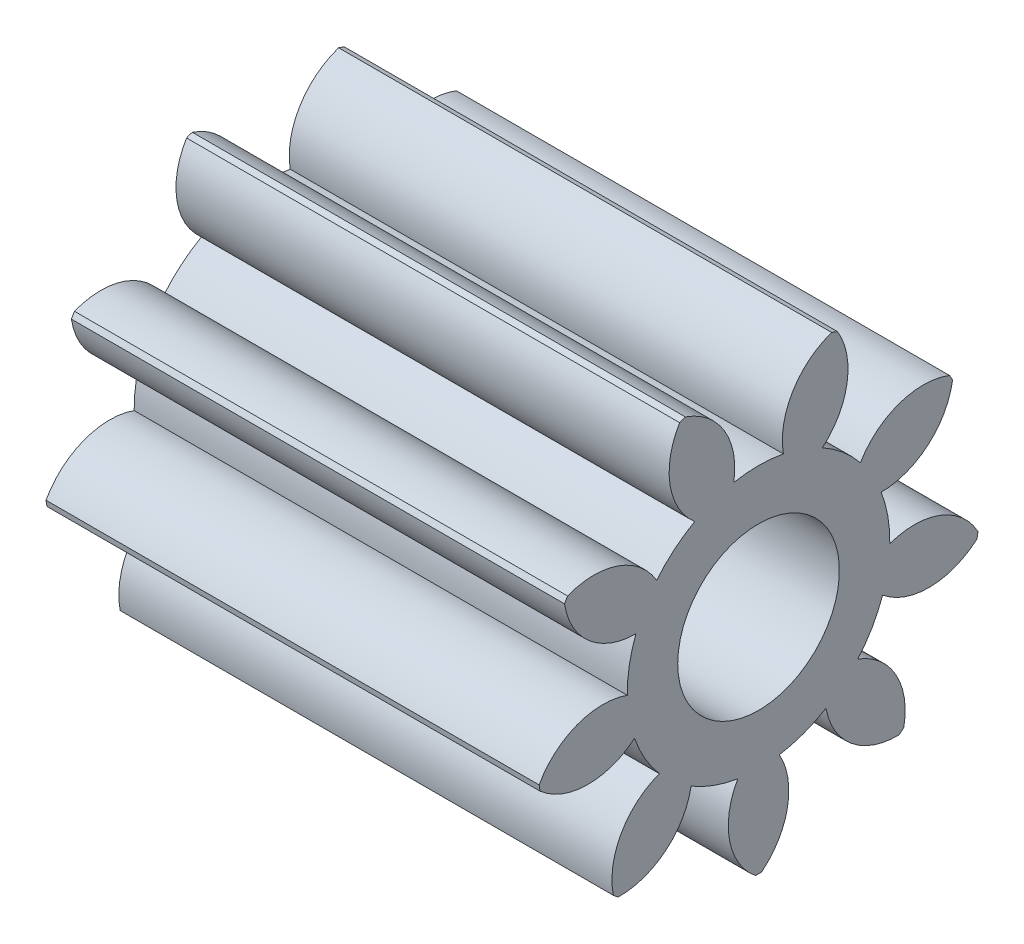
ISO-10303-21;
HEADER;
FILE_DESCRIPTION(('STEP AP214'),'2;1');
FILE_NAME('part.step','',(''),(''),'','','');
FILE_SCHEMA(('AUTOMOTIVE_DESIGN { 1 0 10303 214 1 1 1 1 }'));
ENDSEC;
DATA;
#1=APPLICATION_CONTEXT('core data for automotive mechanical design processes');
#2=APPLICATION_PROTOCOL_DEFINITION('international standard','automotive_design',2000,#1);
#3=PRODUCT_CONTEXT('',#1,'mechanical');
#4=PRODUCT('Part','Part','',(#3));
#5=PRODUCT_RELATED_PRODUCT_CATEGORY('part','',(#4));
#6=PRODUCT_DEFINITION_FORMATION('','',#4);
#7=PRODUCT_DEFINITION_CONTEXT('part definition',#1,'design');
#8=PRODUCT_DEFINITION('design','',#6,#7);
#9=PRODUCT_DEFINITION_SHAPE('','',#8);
#10=(LENGTH_UNIT() NAMED_UNIT(*) SI_UNIT(.MILLI.,.METRE.));
#11=(NAMED_UNIT(*) PLANE_ANGLE_UNIT() SI_UNIT($,.RADIAN.));
#12=(NAMED_UNIT(*) SI_UNIT($,.STERADIAN.) SOLID_ANGLE_UNIT());
#13=UNCERTAINTY_MEASURE_WITH_UNIT(LENGTH_MEASURE(1.E-05),#10,'distance_accuracy_value','');
#14=(GEOMETRIC_REPRESENTATION_CONTEXT(3) GLOBAL_UNCERTAINTY_ASSIGNED_CONTEXT((#13)) GLOBAL_UNIT_ASSIGNED_CONTEXT((#10,
#11,#12)) REPRESENTATION_CONTEXT('',''));
#15=CARTESIAN_POINT('',(0.,0.,0.));
#16=DIRECTION('',(0.,0.,1.));
#17=DIRECTION('',(1.,0.,0.));
#18=AXIS2_PLACEMENT_3D('',#15,#16,#17);
#19=CARTESIAN_POINT('',(6.1,0.,0.));
#20=DIRECTION('',(-1.,0.,0.));
#21=DIRECTION('',(0.,0.,1.));
#22=AXIS2_PLACEMENT_3D('',#19,#20,#21);
#23=PLANE('',#22);
#24=CARTESIAN_POINT('',(6.1,0.568726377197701,-2.03638166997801));
#25=DIRECTION('',(-1.,0.,0.));
#26=DIRECTION('',(0.,-0.64278760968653,-0.766044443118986));
#27=AXIS2_PLACEMENT_3D('',#24,#25,#26);
#28=CIRCLE('',#27,0.899999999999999);
#29=CARTESIAN_POINT('',(6.1,1.02432064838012,-1.26021554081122));
#30=VERTEX_POINT('',#29);
#31=CARTESIAN_POINT('',(6.1,1.4075779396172,-2.36246150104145));
#32=VERTEX_POINT('',#31);
#33=EDGE_CURVE('E276',#30,#32,#28,.T.);
#34=ORIENTED_EDGE('',*,*,#33,.F.);
#35=CARTESIAN_POINT('',(6.1,0.,0.));
#36=DIRECTION('',(-1.,0.,0.));
#37=DIRECTION('',(0.,-0.64278760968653,-0.766044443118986));
#38=AXIS2_PLACEMENT_3D('',#35,#36,#37);
#39=CIRCLE('',#38,1.624);
#40=CARTESIAN_POINT('',(6.1,1.4189414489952,-0.78992478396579));
#41=VERTEX_POINT('',#40);
#42=EDGE_CURVE('E477',#41,#30,#39,.T.);
#43=ORIENTED_EDGE('',*,*,#42,.F.);
#44=CARTESIAN_POINT('',(6.1,2.1042027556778,-0.206472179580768));
#45=DIRECTION('',(-1.,0.,0.));
#46=DIRECTION('',(0.,-0.64278760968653,-0.766044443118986));
#47=AXIS2_PLACEMENT_3D('',#44,#45,#46);
#48=CIRCLE('',#47,0.899999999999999);
#49=CARTESIAN_POINT('',(6.1,2.5709937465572,-0.975956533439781));
#50=VERTEX_POINT('',#49);
#51=EDGE_CURVE('E266',#50,#41,#48,.T.);
#52=ORIENTED_EDGE('',*,*,#51,.F.);
#53=CARTESIAN_POINT('',(6.1,0.,0.));
#54=DIRECTION('',(-1.,0.,0.));
#55=DIRECTION('',(0.,0.,1.));
#56=AXIS2_PLACEMENT_3D('',#53,#54,#55);
#57=CIRCLE('',#56,2.75);
#58=CARTESIAN_POINT('',(6.1,2.59682824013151,-0.904976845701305));
#59=VERTEX_POINT('',#58);
#60=EDGE_CURVE('E294',#59,#50,#57,.T.);
#61=ORIENTED_EDGE('',*,*,#60,.F.);
#62=CARTESIAN_POINT('',(6.1,1.74463058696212,-1.19438859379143));
#63=DIRECTION('',(-1.,0.,0.));
#64=DIRECTION('',(0.,0.,-1.));
#65=AXIS2_PLACEMENT_3D('',#62,#63,#64);
#66=CIRCLE('',#65,0.899999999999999);
#67=CARTESIAN_POINT('',(6.1,1.59472607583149,-0.306960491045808));
#68=VERTEX_POINT('',#67);
#69=EDGE_CURVE('E318',#68,#59,#66,.T.);
#70=ORIENTED_EDGE('',*,*,#69,.F.);
#71=CARTESIAN_POINT('',(6.1,0.,0.));
#72=DIRECTION('',(-1.,0.,0.));
#73=DIRECTION('',(0.,0.,-1.));
#74=AXIS2_PLACEMENT_3D('',#71,#72,#73);
#75=CIRCLE('',#74,1.624);
#76=CARTESIAN_POINT('',(6.1,1.59472607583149,0.306960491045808));
#77=VERTEX_POINT('',#76);
#78=EDGE_CURVE('E314',#77,#68,#75,.T.);
#79=ORIENTED_EDGE('',*,*,#78,.F.);
#80=CARTESIAN_POINT('',(6.1,1.74463058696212,1.19438859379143));
#81=DIRECTION('',(-1.,0.,0.));
#82=DIRECTION('',(0.,0.,-1.));
#83=AXIS2_PLACEMENT_3D('',#80,#81,#82);
#84=CIRCLE('',#83,0.899999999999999);
#85=CARTESIAN_POINT('',(6.1,2.59682824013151,0.904976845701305));
#86=VERTEX_POINT('',#85);
#87=EDGE_CURVE('E316',#86,#77,#84,.T.);
#88=ORIENTED_EDGE('',*,*,#87,.F.);
#89=CARTESIAN_POINT('',(6.1,2.57099374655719,0.975956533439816));
#90=VERTEX_POINT('',#89);
#91=EDGE_CURVE('E288',#90,#86,#57,.T.);
#92=ORIENTED_EDGE('',*,*,#91,.F.);
#93=CARTESIAN_POINT('',(6.1,2.10420275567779,0.206472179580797));
#94=DIRECTION('',(-1.,0.,0.));
#95=DIRECTION('',(0.,0.642787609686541,-0.766044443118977));
#96=AXIS2_PLACEMENT_3D('',#93,#94,#95);
#97=CIRCLE('',#96,0.899999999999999);
#98=CARTESIAN_POINT('',(6.1,1.41894144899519,0.789924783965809));
#99=VERTEX_POINT('',#98);
#100=EDGE_CURVE('E337',#99,#90,#97,.T.);
#101=ORIENTED_EDGE('',*,*,#100,.F.);
#102=CARTESIAN_POINT('',(6.1,0.,0.));
#103=DIRECTION('',(-1.,0.,0.));
#104=DIRECTION('',(0.,0.642787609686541,-0.766044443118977));
#105=AXIS2_PLACEMENT_3D('',#102,#103,#104);
#106=CIRCLE('',#105,1.624);
#107=CARTESIAN_POINT('',(6.1,1.02432064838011,1.26021554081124));
#108=VERTEX_POINT('',#107);
#109=EDGE_CURVE('E333',#108,#99,#106,.T.);
#110=ORIENTED_EDGE('',*,*,#109,.F.);
#111=CARTESIAN_POINT('',(6.1,0.568726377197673,2.03638166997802));
#112=DIRECTION('',(-1.,0.,0.));
#113=DIRECTION('',(0.,0.642787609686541,-0.766044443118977));
#114=AXIS2_PLACEMENT_3D('',#111,#112,#113);
#115=CIRCLE('',#114,0.899999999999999);
#116=CARTESIAN_POINT('',(6.1,1.40757793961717,2.36246150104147));
#117=VERTEX_POINT('',#116);
#118=EDGE_CURVE('E335',#117,#108,#115,.T.);
#119=ORIENTED_EDGE('',*,*,#118,.F.);
#120=CARTESIAN_POINT('',(6.1,1.34216270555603,2.40022900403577));
#121=VERTEX_POINT('',#120);
#122=EDGE_CURVE('E292',#121,#117,#57,.T.);
#123=ORIENTED_EDGE('',*,*,#122,.F.);
#124=CARTESIAN_POINT('',(6.1,1.4791950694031,1.51072232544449));
#125=DIRECTION('',(-1.,0.,0.));
#126=DIRECTION('',(0.,0.984807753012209,-0.173648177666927));
#127=AXIS2_PLACEMENT_3D('',#124,#125,#126);
#128=CIRCLE('',#127,0.899999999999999);
#129=CARTESIAN_POINT('',(6.1,0.579218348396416,1.51719547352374));
#130=VERTEX_POINT('',#129);
#131=EDGE_CURVE('E358',#130,#121,#128,.T.);
#132=ORIENTED_EDGE('',*,*,#131,.F.);
#133=CARTESIAN_POINT('',(6.1,0.,0.));
#134=DIRECTION('',(-1.,0.,0.));
#135=DIRECTION('',(0.,0.984807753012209,-0.173648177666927));
#136=AXIS2_PLACEMENT_3D('',#133,#134,#135);
#137=CIRCLE('',#136,1.624);
#138=CARTESIAN_POINT('',(6.1,-0.0253757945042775,1.62380173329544));
#139=VERTEX_POINT('',#138);
#140=EDGE_CURVE('E354',#139,#130,#137,.T.);
#141=ORIENTED_EDGE('',*,*,#140,.F.);
#142=CARTESIAN_POINT('',(6.1,-0.873291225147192,1.92552913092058));
#143=DIRECTION('',(-1.,0.,0.));
#144=DIRECTION('',(0.,0.984807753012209,-0.173648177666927));
#145=AXIS2_PLACEMENT_3D('',#142,#143,#144);
#146=CIRCLE('',#145,0.899999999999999);
#147=CARTESIAN_POINT('',(6.1,-0.440293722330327,2.71452416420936));
#148=VERTEX_POINT('',#147);
#149=EDGE_CURVE('E356',#148,#139,#146,.T.);
#150=ORIENTED_EDGE('',*,*,#149,.F.);
#151=CARTESIAN_POINT('',(6.1,-0.514681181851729,2.70140764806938));
#152=VERTEX_POINT('',#151);
#153=EDGE_CURVE('E583',#152,#148,#57,.T.);
#154=ORIENTED_EDGE('',*,*,#153,.F.);
#155=CARTESIAN_POINT('',(6.1,0.162055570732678,2.10808870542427));
#156=DIRECTION('',(-1.,0.,0.));
#157=DIRECTION('',(0.,0.866025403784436,0.500000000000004));
#158=AXIS2_PLACEMENT_3D('',#155,#156,#157);
#159=CIRCLE('',#158,0.899999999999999);
#160=CARTESIAN_POINT('',(6.1,-0.531527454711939,1.53455353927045));
#161=VERTEX_POINT('',#160);
#162=EDGE_CURVE('E380',#161,#152,#159,.T.);
#163=ORIENTED_EDGE('',*,*,#162,.F.);
#164=CARTESIAN_POINT('',(6.1,0.,0.));
#165=DIRECTION('',(-1.,0.,0.));
#166=DIRECTION('',(0.,0.866025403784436,0.500000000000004));
#167=AXIS2_PLACEMENT_3D('',#164,#165,#166);
#168=CIRCLE('',#167,1.624);
#169=CARTESIAN_POINT('',(6.1,-1.06319862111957,1.22759304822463));
#170=VERTEX_POINT('',#169);
#171=EDGE_CURVE('E376',#170,#161,#168,.T.);
#172=ORIENTED_EDGE('',*,*,#171,.F.);
#173=CARTESIAN_POINT('',(6.1,-1.90668615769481,0.913700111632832));
#174=DIRECTION('',(-1.,0.,0.));
#175=DIRECTION('',(0.,0.866025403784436,0.500000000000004));
#176=AXIS2_PLACEMENT_3D('',#173,#174,#175);
#177=CIRCLE('',#176,0.899999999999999);
#178=CARTESIAN_POINT('',(6.1,-2.0821470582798,1.79643080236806));
#179=VERTEX_POINT('',#178);
#180=EDGE_CURVE('E378',#179,#170,#177,.T.);
#181=ORIENTED_EDGE('',*,*,#180,.F.);
#182=CARTESIAN_POINT('',(6.1,-2.13070002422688,1.73856763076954));
#183=VERTEX_POINT('',#182);
#184=EDGE_CURVE('E578',#183,#179,#57,.T.);
#185=ORIENTED_EDGE('',*,*,#184,.F.);
#186=CARTESIAN_POINT('',(6.1,-1.23091153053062,1.71905695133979));
#187=DIRECTION('',(-1.,0.,0.));
#188=DIRECTION('',(0.,0.342020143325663,0.939692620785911));
#189=AXIS2_PLACEMENT_3D('',#186,#187,#188);
#190=CIRCLE('',#189,0.899999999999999);
#191=CARTESIAN_POINT('',(6.1,-1.39356565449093,0.833876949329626));
#192=VERTEX_POINT('',#191);
#193=EDGE_CURVE('E402',#192,#183,#190,.T.);
#194=ORIENTED_EDGE('',*,*,#193,.F.);
#195=CARTESIAN_POINT('',(6.1,0.,0.));
#196=DIRECTION('',(-1.,0.,0.));
#197=DIRECTION('',(0.,0.342020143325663,0.939692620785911));
#198=AXIS2_PLACEMENT_3D('',#195,#196,#197);
#199=CIRCLE('',#198,1.624);
#200=CARTESIAN_POINT('',(6.1,-1.60353899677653,0.256979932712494));
#201=VERTEX_POINT('',#200);
#202=EDGE_CURVE('E398',#201,#192,#199,.T.);
#203=ORIENTED_EDGE('',*,*,#202,.F.);
#204=CARTESIAN_POINT('',(6.1,-2.04792144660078,-0.525659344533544));
#205=DIRECTION('',(-1.,0.,0.));
#206=DIRECTION('',(0.,0.342020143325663,0.939692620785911));
#207=AXIS2_PLACEMENT_3D('',#204,#205,#206);
#208=CIRCLE('',#207,0.899999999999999);
#209=CARTESIAN_POINT('',(6.1,-2.74974064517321,0.0377675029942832));
#210=VERTEX_POINT('',#209);
#211=EDGE_CURVE('E400',#210,#201,#208,.T.);
#212=ORIENTED_EDGE('',*,*,#211,.F.);
#213=CARTESIAN_POINT('',(6.1,-2.74974064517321,-0.0377675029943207));
#214=VERTEX_POINT('',#213);
#215=EDGE_CURVE('E573',#214,#210,#57,.T.);
#216=ORIENTED_EDGE('',*,*,#215,.F.);
#217=CARTESIAN_POINT('',(6.1,-2.04792144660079,0.525659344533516));
#218=DIRECTION('',(-1.,0.,0.));
#219=DIRECTION('',(0.,-0.342020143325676,0.939692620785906));
#220=AXIS2_PLACEMENT_3D('',#217,#218,#219);
#221=CIRCLE('',#220,0.899999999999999);
#222=CARTESIAN_POINT('',(6.1,-1.60353899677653,-0.256979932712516));
#223=VERTEX_POINT('',#222);
#224=EDGE_CURVE('E424',#223,#214,#221,.T.);
#225=ORIENTED_EDGE('',*,*,#224,.F.);
#226=CARTESIAN_POINT('',(6.1,0.,0.));
#227=DIRECTION('',(-1.,0.,0.));
#228=DIRECTION('',(0.,-0.342020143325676,0.939692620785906));
#229=AXIS2_PLACEMENT_3D('',#226,#227,#228);
#230=CIRCLE('',#229,1.624);
#231=CARTESIAN_POINT('',(6.1,-1.39356565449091,-0.833876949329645));
#232=VERTEX_POINT('',#231);
#233=EDGE_CURVE('E420',#232,#223,#230,.T.);
#234=ORIENTED_EDGE('',*,*,#233,.F.);
#235=CARTESIAN_POINT('',(6.1,-1.23091153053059,-1.7190569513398));
#236=DIRECTION('',(-1.,0.,0.));
#237=DIRECTION('',(0.,-0.342020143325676,0.939692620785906));
#238=AXIS2_PLACEMENT_3D('',#235,#236,#237);
#239=CIRCLE('',#238,0.899999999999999);
#240=CARTESIAN_POINT('',(6.1,-2.13070002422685,-1.73856763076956));
#241=VERTEX_POINT('',#240);
#242=EDGE_CURVE('E422',#241,#232,#239,.T.);
#243=ORIENTED_EDGE('',*,*,#242,.F.);
#244=CARTESIAN_POINT('',(6.1,-2.08214705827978,-1.79643080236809));
#245=VERTEX_POINT('',#244);
#246=EDGE_CURVE('E568',#245,#241,#57,.T.);
#247=ORIENTED_EDGE('',*,*,#246,.F.);
#248=CARTESIAN_POINT('',(6.1,-1.9066861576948,-0.913700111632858));
#249=DIRECTION('',(-1.,0.,0.));
#250=DIRECTION('',(0.,-0.866025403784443,0.499999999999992));
#251=AXIS2_PLACEMENT_3D('',#248,#249,#250);
#252=CIRCLE('',#251,0.899999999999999);
#253=CARTESIAN_POINT('',(6.1,-1.06319862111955,-1.22759304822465));
#254=VERTEX_POINT('',#253);
#255=EDGE_CURVE('E446',#254,#245,#252,.T.);
#256=ORIENTED_EDGE('',*,*,#255,.F.);
#257=CARTESIAN_POINT('',(6.1,0.,0.));
#258=DIRECTION('',(-1.,0.,0.));
#259=DIRECTION('',(0.,-0.866025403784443,0.499999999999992));
#260=AXIS2_PLACEMENT_3D('',#257,#258,#259);
#261=CIRCLE('',#260,1.624);
#262=CARTESIAN_POINT('',(6.1,-0.531527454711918,-1.53455353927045));
#263=VERTEX_POINT('',#262);
#264=EDGE_CURVE('E442',#263,#254,#261,.T.);
#265=ORIENTED_EDGE('',*,*,#264,.F.);
#266=CARTESIAN_POINT('',(6.1,0.162055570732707,-2.10808870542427));
#267=DIRECTION('',(-1.,0.,0.));
#268=DIRECTION('',(0.,-0.866025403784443,0.499999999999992));
#269=AXIS2_PLACEMENT_3D('',#266,#267,#268);
#270=CIRCLE('',#269,0.899999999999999);
#271=CARTESIAN_POINT('',(6.1,-0.514681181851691,-2.70140764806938));
#272=VERTEX_POINT('',#271);
#273=EDGE_CURVE('E444',#272,#263,#270,.T.);
#274=ORIENTED_EDGE('',*,*,#273,.F.);
#275=CARTESIAN_POINT('',(6.1,-0.440293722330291,-2.71452416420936));
#276=VERTEX_POINT('',#275);
#277=EDGE_CURVE('E567',#276,#272,#57,.T.);
#278=ORIENTED_EDGE('',*,*,#277,.F.);
#279=CARTESIAN_POINT('',(6.1,-0.873291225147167,-1.92552913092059));
#280=DIRECTION('',(-1.,0.,0.));
#281=DIRECTION('',(0.,-0.984807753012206,-0.17364817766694));
#282=AXIS2_PLACEMENT_3D('',#279,#280,#281);
#283=CIRCLE('',#282,0.899999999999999);
#284=CARTESIAN_POINT('',(6.1,-0.0253757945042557,-1.62380173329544));
#285=VERTEX_POINT('',#284);
#286=EDGE_CURVE('E467',#285,#276,#283,.T.);
#287=ORIENTED_EDGE('',*,*,#286,.F.);
#288=CARTESIAN_POINT('',(6.1,0.,0.));
#289=DIRECTION('',(-1.,0.,0.));
#290=DIRECTION('',(0.,-0.984807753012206,-0.17364817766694));
#291=AXIS2_PLACEMENT_3D('',#288,#289,#290);
#292=CIRCLE('',#291,1.624);
#293=CARTESIAN_POINT('',(6.1,0.579218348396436,-1.51719547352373));
#294=VERTEX_POINT('',#293);
#295=EDGE_CURVE('E463',#294,#285,#292,.T.);
#296=ORIENTED_EDGE('',*,*,#295,.F.);
#297=CARTESIAN_POINT('',(6.1,1.47919506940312,-1.51072232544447));
#298=DIRECTION('',(-1.,0.,0.));
#299=DIRECTION('',(0.,-0.984807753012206,-0.17364817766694));
#300=AXIS2_PLACEMENT_3D('',#297,#298,#299);
#301=CIRCLE('',#300,0.899999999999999);
#302=CARTESIAN_POINT('',(6.1,1.34216270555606,-2.40022900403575));
#303=VERTEX_POINT('',#302);
#304=EDGE_CURVE('E465',#303,#294,#301,.T.);
#305=ORIENTED_EDGE('',*,*,#304,.F.);
#306=EDGE_CURVE('E540',#32,#303,#57,.T.);
#307=ORIENTED_EDGE('',*,*,#306,.F.);
#308=EDGE_LOOP('',(#34,#43,#52,#61,#70,#79,#88,#92,#101,#110,#119,#123,#132,#141,#150,#154,#163,
#172,#181,#185,#194,#203,#212,#216,#225,#234,#243,#247,#256,#265,#274,#278,#287,#296,#305,#307));
#309=FACE_BOUND('',#308,.T.);
#310=CARTESIAN_POINT('',(6.1,0.,0.));
#311=DIRECTION('',(-1.,0.,0.));
#312=DIRECTION('',(0.,0.,1.));
#313=AXIS2_PLACEMENT_3D('',#310,#311,#312);
#314=CIRCLE('',#313,0.999999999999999);
#315=CARTESIAN_POINT('',(6.1,0.,0.999999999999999));
#316=VERTEX_POINT('',#315);
#317=EDGE_CURVE('E482',#316,#316,#314,.F.);
#318=ORIENTED_EDGE('',*,*,#317,.F.);
#319=EDGE_LOOP('',(#318));
#320=FACE_BOUND('',#319,.T.);
#321=ADVANCED_FACE('F27',(#309,#320),#23,.F.);
#322=CARTESIAN_POINT('',(0.,0.,0.));
#323=DIRECTION('',(1.,0.,0.));
#324=DIRECTION('',(0.,0.,-1.));
#325=AXIS2_PLACEMENT_3D('',#322,#323,#324);
#326=PLANE('',#325);
#327=CARTESIAN_POINT('',(0.,0.568726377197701,-2.03638166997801));
#328=DIRECTION('',(-1.,0.,0.));
#329=DIRECTION('',(0.,-0.64278760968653,-0.766044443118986));
#330=AXIS2_PLACEMENT_3D('',#327,#328,#329);
#331=CIRCLE('',#330,0.899999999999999);
#332=CARTESIAN_POINT('',(0.,1.02432064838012,-1.26021554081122));
#333=VERTEX_POINT('',#332);
#334=CARTESIAN_POINT('',(0.,1.4075779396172,-2.36246150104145));
#335=VERTEX_POINT('',#334);
#336=EDGE_CURVE('E42',#333,#335,#331,.T.);
#337=ORIENTED_EDGE('',*,*,#336,.T.);
#338=CARTESIAN_POINT('',(0.,0.,0.));
#339=DIRECTION('',(-1.,0.,0.));
#340=DIRECTION('',(0.,0.,1.));
#341=AXIS2_PLACEMENT_3D('',#338,#339,#340);
#342=CIRCLE('',#341,2.75);
#343=CARTESIAN_POINT('',(0.,1.34216270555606,-2.40022900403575));
#344=VERTEX_POINT('',#343);
#345=EDGE_CURVE('E289',#335,#344,#342,.T.);
#346=ORIENTED_EDGE('',*,*,#345,.T.);
#347=CARTESIAN_POINT('',(0.,1.47919506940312,-1.51072232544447));
#348=DIRECTION('',(1.,0.,0.));
#349=DIRECTION('',(0.,0.,-1.));
#350=AXIS2_PLACEMENT_3D('',#347,#348,#349);
#351=CIRCLE('',#350,0.899999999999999);
#352=CARTESIAN_POINT('',(0.,0.579218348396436,-1.51719547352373));
#353=VERTEX_POINT('',#352);
#354=EDGE_CURVE('E35',#353,#344,#351,.T.);
#355=ORIENTED_EDGE('',*,*,#354,.F.);
#356=CARTESIAN_POINT('',(0.,0.,0.));
#357=DIRECTION('',(-1.,0.,0.));
#358=DIRECTION('',(0.,-0.984807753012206,-0.17364817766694));
#359=AXIS2_PLACEMENT_3D('',#356,#357,#358);
#360=CIRCLE('',#359,1.624);
#361=CARTESIAN_POINT('',(0.,-0.0253757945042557,-1.62380173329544));
#362=VERTEX_POINT('',#361);
#363=EDGE_CURVE('E469',#353,#362,#360,.T.);
#364=ORIENTED_EDGE('',*,*,#363,.T.);
#365=CARTESIAN_POINT('',(0.,-0.873291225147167,-1.92552913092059));
#366=DIRECTION('',(-1.,0.,0.));
#367=DIRECTION('',(0.,-0.984807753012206,-0.17364817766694));
#368=AXIS2_PLACEMENT_3D('',#365,#366,#367);
#369=CIRCLE('',#368,0.899999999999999);
#370=CARTESIAN_POINT('',(0.,-0.440293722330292,-2.71452416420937));
#371=VERTEX_POINT('',#370);
#372=EDGE_CURVE('E50',#362,#371,#369,.T.);
#373=ORIENTED_EDGE('',*,*,#372,.T.);
#374=CARTESIAN_POINT('',(0.,-0.51468118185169,-2.70140764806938));
#375=VERTEX_POINT('',#374);
#376=EDGE_CURVE('E295',#371,#375,#342,.T.);
#377=ORIENTED_EDGE('',*,*,#376,.T.);
#378=CARTESIAN_POINT('',(0.,0.162055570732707,-2.10808870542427));
#379=DIRECTION('',(1.,0.,0.));
#380=DIRECTION('',(0.,0.,-1.));
#381=AXIS2_PLACEMENT_3D('',#378,#379,#380);
#382=CIRCLE('',#381,0.899999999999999);
#383=CARTESIAN_POINT('',(0.,-0.531527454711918,-1.53455353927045));
#384=VERTEX_POINT('',#383);
#385=EDGE_CURVE('E553',#384,#375,#382,.T.);
#386=ORIENTED_EDGE('',*,*,#385,.F.);
#387=CARTESIAN_POINT('',(0.,0.,0.));
#388=DIRECTION('',(-1.,0.,0.));
#389=DIRECTION('',(0.,-0.866025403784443,0.499999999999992));
#390=AXIS2_PLACEMENT_3D('',#387,#388,#389);
#391=CIRCLE('',#390,1.624);
#392=CARTESIAN_POINT('',(0.,-1.06319862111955,-1.22759304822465));
#393=VERTEX_POINT('',#392);
#394=EDGE_CURVE('E448',#384,#393,#391,.T.);
#395=ORIENTED_EDGE('',*,*,#394,.T.);
#396=CARTESIAN_POINT('',(0.,-1.9066861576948,-0.913700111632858));
#397=DIRECTION('',(-1.,0.,0.));
#398=DIRECTION('',(0.,-0.866025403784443,0.499999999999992));
#399=AXIS2_PLACEMENT_3D('',#396,#397,#398);
#400=CIRCLE('',#399,0.899999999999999);
#401=CARTESIAN_POINT('',(0.,-2.08214705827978,-1.79643080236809));
#402=VERTEX_POINT('',#401);
#403=EDGE_CURVE('E451',#393,#402,#400,.T.);
#404=ORIENTED_EDGE('',*,*,#403,.T.);
#405=CARTESIAN_POINT('',(0.,-2.13070002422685,-1.73856763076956));
#406=VERTEX_POINT('',#405);
#407=EDGE_CURVE('E625',#402,#406,#342,.T.);
#408=ORIENTED_EDGE('',*,*,#407,.T.);
#409=CARTESIAN_POINT('',(0.,-1.23091153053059,-1.7190569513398));
#410=DIRECTION('',(1.,0.,0.));
#411=DIRECTION('',(0.,0.,-1.));
#412=AXIS2_PLACEMENT_3D('',#409,#410,#411);
#413=CIRCLE('',#412,0.899999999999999);
#414=CARTESIAN_POINT('',(0.,-1.39356565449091,-0.833876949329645));
#415=VERTEX_POINT('',#414);
#416=EDGE_CURVE('E550',#415,#406,#413,.T.);
#417=ORIENTED_EDGE('',*,*,#416,.F.);
#418=CARTESIAN_POINT('',(0.,0.,0.));
#419=DIRECTION('',(-1.,0.,0.));
#420=DIRECTION('',(0.,-0.342020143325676,0.939692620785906));
#421=AXIS2_PLACEMENT_3D('',#418,#419,#420);
#422=CIRCLE('',#421,1.624);
#423=CARTESIAN_POINT('',(0.,-1.60353899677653,-0.256979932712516));
#424=VERTEX_POINT('',#423);
#425=EDGE_CURVE('E426',#415,#424,#422,.T.);
#426=ORIENTED_EDGE('',*,*,#425,.T.);
#427=CARTESIAN_POINT('',(0.,-2.04792144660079,0.525659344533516));
#428=DIRECTION('',(-1.,0.,0.));
#429=DIRECTION('',(0.,-0.342020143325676,0.939692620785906));
#430=AXIS2_PLACEMENT_3D('',#427,#428,#429);
#431=CIRCLE('',#430,0.899999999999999);
#432=CARTESIAN_POINT('',(0.,-2.74974064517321,-0.0377675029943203));
#433=VERTEX_POINT('',#432);
#434=EDGE_CURVE('E429',#424,#433,#431,.T.);
#435=ORIENTED_EDGE('',*,*,#434,.T.);
#436=CARTESIAN_POINT('',(0.,-2.74974064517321,0.0377675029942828));
#437=VERTEX_POINT('',#436);
#438=EDGE_CURVE('E622',#433,#437,#342,.T.);
#439=ORIENTED_EDGE('',*,*,#438,.T.);
#440=CARTESIAN_POINT('',(0.,-2.04792144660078,-0.525659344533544));
#441=DIRECTION('',(1.,0.,0.));
#442=DIRECTION('',(0.,0.,-1.));
#443=AXIS2_PLACEMENT_3D('',#440,#441,#442);
#444=CIRCLE('',#443,0.899999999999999);
#445=CARTESIAN_POINT('',(0.,-1.60353899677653,0.256979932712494));
#446=VERTEX_POINT('',#445);
#447=EDGE_CURVE('E547',#446,#437,#444,.T.);
#448=ORIENTED_EDGE('',*,*,#447,.F.);
#449=CARTESIAN_POINT('',(0.,0.,0.));
#450=DIRECTION('',(-1.,0.,0.));
#451=DIRECTION('',(0.,0.342020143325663,0.939692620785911));
#452=AXIS2_PLACEMENT_3D('',#449,#450,#451);
#453=CIRCLE('',#452,1.624);
#454=CARTESIAN_POINT('',(0.,-1.39356565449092,0.833876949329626));
#455=VERTEX_POINT('',#454);
#456=EDGE_CURVE('E404',#446,#455,#453,.T.);
#457=ORIENTED_EDGE('',*,*,#456,.T.);
#458=CARTESIAN_POINT('',(0.,-1.23091153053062,1.71905695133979));
#459=DIRECTION('',(-1.,0.,0.));
#460=DIRECTION('',(0.,0.342020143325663,0.939692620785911));
#461=AXIS2_PLACEMENT_3D('',#458,#459,#460);
#462=CIRCLE('',#461,0.899999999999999);
#463=CARTESIAN_POINT('',(0.,-2.13070002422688,1.73856763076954));
#464=VERTEX_POINT('',#463);
#465=EDGE_CURVE('E407',#455,#464,#462,.T.);
#466=ORIENTED_EDGE('',*,*,#465,.T.);
#467=CARTESIAN_POINT('',(0.,-2.0821470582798,1.79643080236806));
#468=VERTEX_POINT('',#467);
#469=EDGE_CURVE('E621',#464,#468,#342,.T.);
#470=ORIENTED_EDGE('',*,*,#469,.T.);
#471=CARTESIAN_POINT('',(0.,-1.90668615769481,0.913700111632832));
#472=DIRECTION('',(1.,0.,0.));
#473=DIRECTION('',(0.,0.,-1.));
#474=AXIS2_PLACEMENT_3D('',#471,#472,#473);
#475=CIRCLE('',#474,0.899999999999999);
#476=CARTESIAN_POINT('',(0.,-1.06319862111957,1.22759304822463));
#477=VERTEX_POINT('',#476);
#478=EDGE_CURVE('E544',#477,#468,#475,.T.);
#479=ORIENTED_EDGE('',*,*,#478,.F.);
#480=CARTESIAN_POINT('',(0.,0.,0.));
#481=DIRECTION('',(-1.,0.,0.));
#482=DIRECTION('',(0.,0.866025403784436,0.500000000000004));
#483=AXIS2_PLACEMENT_3D('',#480,#481,#482);
#484=CIRCLE('',#483,1.624);
#485=CARTESIAN_POINT('',(0.,-0.531527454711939,1.53455353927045));
#486=VERTEX_POINT('',#485);
#487=EDGE_CURVE('E382',#477,#486,#484,.T.);
#488=ORIENTED_EDGE('',*,*,#487,.T.);
#489=CARTESIAN_POINT('',(0.,0.162055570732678,2.10808870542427));
#490=DIRECTION('',(-1.,0.,0.));
#491=DIRECTION('',(0.,0.866025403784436,0.500000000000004));
#492=AXIS2_PLACEMENT_3D('',#489,#490,#491);
#493=CIRCLE('',#492,0.899999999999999);
#494=CARTESIAN_POINT('',(0.,-0.514681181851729,2.70140764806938));
#495=VERTEX_POINT('',#494);
#496=EDGE_CURVE('E385',#486,#495,#493,.T.);
#497=ORIENTED_EDGE('',*,*,#496,.T.);
#498=CARTESIAN_POINT('',(0.,-0.440293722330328,2.71452416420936));
#499=VERTEX_POINT('',#498);
#500=EDGE_CURVE('E303',#495,#499,#342,.T.);
#501=ORIENTED_EDGE('',*,*,#500,.T.);
#502=CARTESIAN_POINT('',(0.,-0.873291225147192,1.92552913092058));
#503=DIRECTION('',(1.,0.,0.));
#504=DIRECTION('',(0.,0.,-1.));
#505=AXIS2_PLACEMENT_3D('',#502,#503,#504);
#506=CIRCLE('',#505,0.899999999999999);
#507=CARTESIAN_POINT('',(0.,-0.0253757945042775,1.62380173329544));
#508=VERTEX_POINT('',#507);
#509=EDGE_CURVE('E537',#508,#499,#506,.T.);
#510=ORIENTED_EDGE('',*,*,#509,.F.);
#511=CARTESIAN_POINT('',(0.,0.,0.));
#512=DIRECTION('',(-1.,0.,0.));
#513=DIRECTION('',(0.,0.984807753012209,-0.173648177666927));
#514=AXIS2_PLACEMENT_3D('',#511,#512,#513);
#515=CIRCLE('',#514,1.624);
#516=CARTESIAN_POINT('',(0.,0.579218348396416,1.51719547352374));
#517=VERTEX_POINT('',#516);
#518=EDGE_CURVE('E360',#508,#517,#515,.T.);
#519=ORIENTED_EDGE('',*,*,#518,.T.);
#520=CARTESIAN_POINT('',(0.,1.4791950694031,1.51072232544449));
#521=DIRECTION('',(-1.,0.,0.));
#522=DIRECTION('',(0.,0.984807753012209,-0.173648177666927));
#523=AXIS2_PLACEMENT_3D('',#520,#521,#522);
#524=CIRCLE('',#523,0.899999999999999);
#525=CARTESIAN_POINT('',(0.,1.34216270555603,2.40022900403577));
#526=VERTEX_POINT('',#525);
#527=EDGE_CURVE('E363',#517,#526,#524,.T.);
#528=ORIENTED_EDGE('',*,*,#527,.T.);
#529=CARTESIAN_POINT('',(0.,1.40757793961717,2.36246150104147));
#530=VERTEX_POINT('',#529);
#531=EDGE_CURVE('E297',#526,#530,#342,.T.);
#532=ORIENTED_EDGE('',*,*,#531,.T.);
#533=CARTESIAN_POINT('',(0.,0.568726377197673,2.03638166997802));
#534=DIRECTION('',(1.,0.,0.));
#535=DIRECTION('',(0.,0.,-1.));
#536=AXIS2_PLACEMENT_3D('',#533,#534,#535);
#537=CIRCLE('',#536,0.899999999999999);
#538=CARTESIAN_POINT('',(0.,1.02432064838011,1.26021554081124));
#539=VERTEX_POINT('',#538);
#540=EDGE_CURVE('E534',#539,#530,#537,.T.);
#541=ORIENTED_EDGE('',*,*,#540,.F.);
#542=CARTESIAN_POINT('',(0.,0.,0.));
#543=DIRECTION('',(-1.,0.,0.));
#544=DIRECTION('',(0.,0.642787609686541,-0.766044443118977));
#545=AXIS2_PLACEMENT_3D('',#542,#543,#544);
#546=CIRCLE('',#545,1.624);
#547=CARTESIAN_POINT('',(0.,1.41894144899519,0.789924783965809));
#548=VERTEX_POINT('',#547);
#549=EDGE_CURVE('E339',#539,#548,#546,.T.);
#550=ORIENTED_EDGE('',*,*,#549,.T.);
#551=CARTESIAN_POINT('',(0.,2.10420275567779,0.206472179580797));
#552=DIRECTION('',(-1.,0.,0.));
#553=DIRECTION('',(0.,0.642787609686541,-0.766044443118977));
#554=AXIS2_PLACEMENT_3D('',#551,#552,#553);
#555=CIRCLE('',#554,0.899999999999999);
#556=CARTESIAN_POINT('',(0.,2.57099374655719,0.975956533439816));
#557=VERTEX_POINT('',#556);
#558=EDGE_CURVE('E342',#548,#557,#555,.T.);
#559=ORIENTED_EDGE('',*,*,#558,.T.);
#560=CARTESIAN_POINT('',(0.,2.59682824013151,0.904976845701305));
#561=VERTEX_POINT('',#560);
#562=EDGE_CURVE('E291',#557,#561,#342,.T.);
#563=ORIENTED_EDGE('',*,*,#562,.T.);
#564=CARTESIAN_POINT('',(0.,1.74463058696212,1.19438859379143));
#565=DIRECTION('',(1.,0.,0.));
#566=DIRECTION('',(0.,0.,-1.));
#567=AXIS2_PLACEMENT_3D('',#564,#565,#566);
#568=CIRCLE('',#567,0.899999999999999);
#569=CARTESIAN_POINT('',(0.,1.59472607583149,0.306960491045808));
#570=VERTEX_POINT('',#569);
#571=EDGE_CURVE('E533',#570,#561,#568,.T.);
#572=ORIENTED_EDGE('',*,*,#571,.F.);
#573=CARTESIAN_POINT('',(0.,0.,0.));
#574=DIRECTION('',(-1.,0.,0.));
#575=DIRECTION('',(0.,0.,-1.));
#576=AXIS2_PLACEMENT_3D('',#573,#574,#575);
#577=CIRCLE('',#576,1.624);
#578=CARTESIAN_POINT('',(0.,1.59472607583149,-0.306960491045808));
#579=VERTEX_POINT('',#578);
#580=EDGE_CURVE('E320',#570,#579,#577,.T.);
#581=ORIENTED_EDGE('',*,*,#580,.T.);
#582=CARTESIAN_POINT('',(0.,1.74463058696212,-1.19438859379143));
#583=DIRECTION('',(-1.,0.,0.));
#584=DIRECTION('',(0.,0.,-1.));
#585=AXIS2_PLACEMENT_3D('',#582,#583,#584);
#586=CIRCLE('',#585,0.899999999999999);
#587=CARTESIAN_POINT('',(0.,2.59682824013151,-0.904976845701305));
#588=VERTEX_POINT('',#587);
#589=EDGE_CURVE('E285',#579,#588,#586,.T.);
#590=ORIENTED_EDGE('',*,*,#589,.T.);
#591=CARTESIAN_POINT('',(0.,2.5709937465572,-0.975956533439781));
#592=VERTEX_POINT('',#591);
#593=EDGE_CURVE('E283',#588,#592,#342,.T.);
#594=ORIENTED_EDGE('',*,*,#593,.T.);
#595=CARTESIAN_POINT('',(0.,2.1042027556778,-0.206472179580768));
#596=DIRECTION('',(1.,0.,0.));
#597=DIRECTION('',(0.,0.,-1.));
#598=AXIS2_PLACEMENT_3D('',#595,#596,#597);
#599=CIRCLE('',#598,0.899999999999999);
#600=CARTESIAN_POINT('',(0.,1.4189414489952,-0.78992478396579));
#601=VERTEX_POINT('',#600);
#602=EDGE_CURVE('E11',#601,#592,#599,.T.);
#603=ORIENTED_EDGE('',*,*,#602,.F.);
#604=CARTESIAN_POINT('',(0.,0.,0.));
#605=DIRECTION('',(-1.,0.,0.));
#606=DIRECTION('',(0.,-0.64278760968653,-0.766044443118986));
#607=AXIS2_PLACEMENT_3D('',#604,#605,#606);
#608=CIRCLE('',#607,1.624);
#609=EDGE_CURVE('E273',#601,#333,#608,.T.);
#610=ORIENTED_EDGE('',*,*,#609,.T.);
#611=EDGE_LOOP('',(#337,#346,#355,#364,#373,#377,#386,#395,#404,#408,#417,#426,#435,#439,#448,
#457,#466,#470,#479,#488,#497,#501,#510,#519,#528,#532,#541,#550,#559,#563,#572,#581,#590,#594,
#603,#610));
#612=FACE_BOUND('',#611,.T.);
#613=CARTESIAN_POINT('',(0.,0.,0.));
#614=DIRECTION('',(1.,0.,0.));
#615=DIRECTION('',(0.,0.,-1.));
#616=AXIS2_PLACEMENT_3D('',#613,#614,#615);
#617=CIRCLE('',#616,0.999999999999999);
#618=CARTESIAN_POINT('',(0.,0.,-0.999999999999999));
#619=VERTEX_POINT('',#618);
#620=EDGE_CURVE('E30',#619,#619,#617,.F.);
#621=ORIENTED_EDGE('',*,*,#620,.F.);
#622=EDGE_LOOP('',(#621));
#623=FACE_BOUND('',#622,.T.);
#624=ADVANCED_FACE('F279',(#612,#623),#326,.F.);
#625=CARTESIAN_POINT('',(-10.,0.,0.));
#626=DIRECTION('',(-1.,0.,0.));
#627=DIRECTION('',(0.,0.,1.));
#628=AXIS2_PLACEMENT_3D('',#625,#626,#627);
#629=CYLINDRICAL_SURFACE('',#628,2.75);
#630=DIRECTION('',(-1.,0.,0.));
#631=VECTOR('',#630,1.);
#632=CARTESIAN_POINT('',(3.05,1.4075779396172,-2.36246150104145));
#633=LINE('',#632,#631);
#634=EDGE_CURVE('E473',#32,#335,#633,.T.);
#635=ORIENTED_EDGE('',*,*,#634,.F.);
#636=ORIENTED_EDGE('',*,*,#306,.T.);
#637=DIRECTION('',(-1.,0.,0.));
#638=VECTOR('',#637,1.);
#639=CARTESIAN_POINT('',(3.05,1.34216270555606,-2.40022900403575));
#640=LINE('',#639,#638);
#641=EDGE_CURVE('E456',#344,#303,#640,.F.);
#642=ORIENTED_EDGE('',*,*,#641,.F.);
#643=ORIENTED_EDGE('',*,*,#345,.F.);
#644=EDGE_LOOP('',(#635,#636,#642,#643));
#645=FACE_BOUND('',#644,.T.);
#646=ADVANCED_FACE('F491',(#645),#629,.T.);
#647=DIRECTION('',(-1.,0.,0.));
#648=VECTOR('',#647,1.);
#649=CARTESIAN_POINT('',(3.05,2.5709937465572,-0.975956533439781));
#650=LINE('',#649,#648);
#651=EDGE_CURVE('E269',#592,#50,#650,.F.);
#652=ORIENTED_EDGE('',*,*,#651,.F.);
#653=ORIENTED_EDGE('',*,*,#593,.F.);
#654=DIRECTION('',(-1.,0.,0.));
#655=VECTOR('',#654,1.);
#656=CARTESIAN_POINT('',(3.05,2.59682824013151,-0.904976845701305));
#657=LINE('',#656,#655);
#658=EDGE_CURVE('E298',#59,#588,#657,.T.);
#659=ORIENTED_EDGE('',*,*,#658,.F.);
#660=ORIENTED_EDGE('',*,*,#60,.T.);
#661=EDGE_LOOP('',(#652,#653,#659,#660));
#662=FACE_BOUND('',#661,.T.);
#663=ADVANCED_FACE('F498',(#662),#629,.T.);
#664=DIRECTION('',(-1.,0.,0.));
#665=VECTOR('',#664,1.);
#666=CARTESIAN_POINT('',(3.05,-0.440293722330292,-2.71452416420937));
#667=LINE('',#666,#665);
#668=EDGE_CURVE('E454',#276,#371,#667,.T.);
#669=ORIENTED_EDGE('',*,*,#668,.F.);
#670=ORIENTED_EDGE('',*,*,#277,.T.);
#671=DIRECTION('',(-1.,0.,0.));
#672=VECTOR('',#671,1.);
#673=CARTESIAN_POINT('',(3.05,-0.514681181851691,-2.70140764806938));
#674=LINE('',#673,#672);
#675=EDGE_CURVE('E434',#375,#272,#674,.F.);
#676=ORIENTED_EDGE('',*,*,#675,.F.);
#677=ORIENTED_EDGE('',*,*,#376,.F.);
#678=EDGE_LOOP('',(#669,#670,#676,#677));
#679=FACE_BOUND('',#678,.T.);
#680=ADVANCED_FACE('F637',(#679),#629,.T.);
#681=DIRECTION('',(-1.,0.,0.));
#682=VECTOR('',#681,1.);
#683=CARTESIAN_POINT('',(3.05,-2.08214705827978,-1.79643080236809));
#684=LINE('',#683,#682);
#685=EDGE_CURVE('E432',#245,#402,#684,.T.);
#686=ORIENTED_EDGE('',*,*,#685,.F.);
#687=ORIENTED_EDGE('',*,*,#246,.T.);
#688=DIRECTION('',(-1.,0.,0.));
#689=VECTOR('',#688,1.);
#690=CARTESIAN_POINT('',(3.05,-2.13070002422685,-1.73856763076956));
#691=LINE('',#690,#689);
#692=EDGE_CURVE('E412',#406,#241,#691,.F.);
#693=ORIENTED_EDGE('',*,*,#692,.F.);
#694=ORIENTED_EDGE('',*,*,#407,.F.);
#695=EDGE_LOOP('',(#686,#687,#693,#694));
#696=FACE_BOUND('',#695,.T.);
#697=ADVANCED_FACE('F639',(#696),#629,.T.);
#698=DIRECTION('',(-1.,0.,0.));
#699=VECTOR('',#698,1.);
#700=CARTESIAN_POINT('',(3.05,-2.74974064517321,-0.0377675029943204));
#701=LINE('',#700,#699);
#702=EDGE_CURVE('E410',#214,#433,#701,.T.);
#703=ORIENTED_EDGE('',*,*,#702,.F.);
#704=ORIENTED_EDGE('',*,*,#215,.T.);
#705=DIRECTION('',(-1.,0.,0.));
#706=VECTOR('',#705,1.);
#707=CARTESIAN_POINT('',(3.05,-2.74974064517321,0.0377675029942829));
#708=LINE('',#707,#706);
#709=EDGE_CURVE('E390',#437,#210,#708,.F.);
#710=ORIENTED_EDGE('',*,*,#709,.F.);
#711=ORIENTED_EDGE('',*,*,#438,.F.);
#712=EDGE_LOOP('',(#703,#704,#710,#711));
#713=FACE_BOUND('',#712,.T.);
#714=ADVANCED_FACE('F644',(#713),#629,.T.);
#715=DIRECTION('',(-1.,0.,0.));
#716=VECTOR('',#715,1.);
#717=CARTESIAN_POINT('',(3.05,-2.13070002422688,1.73856763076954));
#718=LINE('',#717,#716);
#719=EDGE_CURVE('E388',#183,#464,#718,.T.);
#720=ORIENTED_EDGE('',*,*,#719,.F.);
#721=ORIENTED_EDGE('',*,*,#184,.T.);
#722=DIRECTION('',(-1.,0.,0.));
#723=VECTOR('',#722,1.);
#724=CARTESIAN_POINT('',(3.05,-2.0821470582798,1.79643080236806));
#725=LINE('',#724,#723);
#726=EDGE_CURVE('E368',#468,#179,#725,.F.);
#727=ORIENTED_EDGE('',*,*,#726,.F.);
#728=ORIENTED_EDGE('',*,*,#469,.F.);
#729=EDGE_LOOP('',(#720,#721,#727,#728));
#730=FACE_BOUND('',#729,.T.);
#731=ADVANCED_FACE('F858',(#730),#629,.T.);
#732=DIRECTION('',(-1.,0.,0.));
#733=VECTOR('',#732,1.);
#734=CARTESIAN_POINT('',(3.05,-0.514681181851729,2.70140764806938));
#735=LINE('',#734,#733);
#736=EDGE_CURVE('E366',#152,#495,#735,.T.);
#737=ORIENTED_EDGE('',*,*,#736,.F.);
#738=ORIENTED_EDGE('',*,*,#153,.T.);
#739=DIRECTION('',(-1.,0.,0.));
#740=VECTOR('',#739,1.);
#741=CARTESIAN_POINT('',(3.05,-0.440293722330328,2.71452416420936));
#742=LINE('',#741,#740);
#743=EDGE_CURVE('E346',#499,#148,#742,.F.);
#744=ORIENTED_EDGE('',*,*,#743,.F.);
#745=ORIENTED_EDGE('',*,*,#500,.F.);
#746=EDGE_LOOP('',(#737,#738,#744,#745));
#747=FACE_BOUND('',#746,.T.);
#748=ADVANCED_FACE('F514',(#747),#629,.T.);
#749=DIRECTION('',(-1.,0.,0.));
#750=VECTOR('',#749,1.);
#751=CARTESIAN_POINT('',(3.05,1.34216270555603,2.40022900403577));
#752=LINE('',#751,#750);
#753=EDGE_CURVE('E344',#121,#526,#752,.T.);
#754=ORIENTED_EDGE('',*,*,#753,.F.);
#755=ORIENTED_EDGE('',*,*,#122,.T.);
#756=DIRECTION('',(-1.,0.,0.));
#757=VECTOR('',#756,1.);
#758=CARTESIAN_POINT('',(3.05,1.40757793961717,2.36246150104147));
#759=LINE('',#758,#757);
#760=EDGE_CURVE('E325',#530,#117,#759,.F.);
#761=ORIENTED_EDGE('',*,*,#760,.F.);
#762=ORIENTED_EDGE('',*,*,#531,.F.);
#763=EDGE_LOOP('',(#754,#755,#761,#762));
#764=FACE_BOUND('',#763,.T.);
#765=ADVANCED_FACE('F506',(#764),#629,.T.);
#766=DIRECTION('',(-1.,0.,0.));
#767=VECTOR('',#766,1.);
#768=CARTESIAN_POINT('',(3.05,2.57099374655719,0.975956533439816));
#769=LINE('',#768,#767);
#770=EDGE_CURVE('E323',#90,#557,#769,.T.);
#771=ORIENTED_EDGE('',*,*,#770,.F.);
#772=ORIENTED_EDGE('',*,*,#91,.T.);
#773=DIRECTION('',(-1.,0.,0.));
#774=VECTOR('',#773,1.);
#775=CARTESIAN_POINT('',(3.05,2.59682824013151,0.904976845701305));
#776=LINE('',#775,#774);
#777=EDGE_CURVE('E304',#561,#86,#776,.F.);
#778=ORIENTED_EDGE('',*,*,#777,.F.);
#779=ORIENTED_EDGE('',*,*,#562,.F.);
#780=EDGE_LOOP('',(#771,#772,#778,#779));
#781=FACE_BOUND('',#780,.T.);
#782=ADVANCED_FACE('F500',(#781),#629,.T.);
#783=CARTESIAN_POINT('',(6.1,1.74463058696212,-1.19438859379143));
#784=DIRECTION('',(-1.,0.,0.));
#785=DIRECTION('',(0.,0.,1.));
#786=AXIS2_PLACEMENT_3D('',#783,#784,#785);
#787=CYLINDRICAL_SURFACE('',#786,0.899999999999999);
#788=ORIENTED_EDGE('',*,*,#658,.T.);
#789=ORIENTED_EDGE('',*,*,#589,.F.);
#790=DIRECTION('',(-1.,0.,0.));
#791=VECTOR('',#790,1.);
#792=CARTESIAN_POINT('',(6.1,1.59472607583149,-0.306960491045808));
#793=LINE('',#792,#791);
#794=EDGE_CURVE('E311',#68,#579,#793,.T.);
#795=ORIENTED_EDGE('',*,*,#794,.F.);
#796=ORIENTED_EDGE('',*,*,#69,.T.);
#797=EDGE_LOOP('',(#788,#789,#795,#796));
#798=FACE_BOUND('',#797,.T.);
#799=ADVANCED_FACE('F503',(#798),#787,.T.);
#800=CARTESIAN_POINT('',(6.1,1.74463058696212,1.19438859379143));
#801=DIRECTION('',(-1.,0.,0.));
#802=DIRECTION('',(0.,0.,1.));
#803=AXIS2_PLACEMENT_3D('',#800,#801,#802);
#804=CYLINDRICAL_SURFACE('',#803,0.899999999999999);
#805=ORIENTED_EDGE('',*,*,#777,.T.);
#806=ORIENTED_EDGE('',*,*,#87,.T.);
#807=DIRECTION('',(-1.,0.,0.));
#808=VECTOR('',#807,1.);
#809=CARTESIAN_POINT('',(6.1,1.59472607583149,0.306960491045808));
#810=LINE('',#809,#808);
#811=EDGE_CURVE('E307',#77,#570,#810,.T.);
#812=ORIENTED_EDGE('',*,*,#811,.T.);
#813=ORIENTED_EDGE('',*,*,#571,.T.);
#814=EDGE_LOOP('',(#805,#806,#812,#813));
#815=FACE_BOUND('',#814,.T.);
#816=ADVANCED_FACE('F513',(#815),#804,.T.);
#817=CARTESIAN_POINT('',(6.1,0.,0.));
#818=DIRECTION('',(-1.,0.,0.));
#819=DIRECTION('',(0.,0.,1.));
#820=AXIS2_PLACEMENT_3D('',#817,#818,#819);
#821=CYLINDRICAL_SURFACE('',#820,1.624);
#822=ORIENTED_EDGE('',*,*,#580,.F.);
#823=ORIENTED_EDGE('',*,*,#811,.F.);
#824=ORIENTED_EDGE('',*,*,#78,.T.);
#825=ORIENTED_EDGE('',*,*,#794,.T.);
#826=EDGE_LOOP('',(#822,#823,#824,#825));
#827=FACE_BOUND('',#826,.T.);
#828=ADVANCED_FACE('F531',(#827),#821,.T.);
#829=CARTESIAN_POINT('',(6.1,2.10420275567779,0.206472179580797));
#830=DIRECTION('',(-1.,0.,0.));
#831=DIRECTION('',(0.,0.,1.));
#832=AXIS2_PLACEMENT_3D('',#829,#830,#831);
#833=CYLINDRICAL_SURFACE('',#832,0.899999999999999);
#834=ORIENTED_EDGE('',*,*,#770,.T.);
#835=ORIENTED_EDGE('',*,*,#558,.F.);
#836=DIRECTION('',(-1.,0.,0.));
#837=VECTOR('',#836,1.);
#838=CARTESIAN_POINT('',(6.1,1.41894144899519,0.789924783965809));
#839=LINE('',#838,#837);
#840=EDGE_CURVE('E330',#99,#548,#839,.T.);
#841=ORIENTED_EDGE('',*,*,#840,.F.);
#842=ORIENTED_EDGE('',*,*,#100,.T.);
#843=EDGE_LOOP('',(#834,#835,#841,#842));
#844=FACE_BOUND('',#843,.T.);
#845=ADVANCED_FACE('F606',(#844),#833,.T.);
#846=CARTESIAN_POINT('',(6.1,0.568726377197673,2.03638166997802));
#847=DIRECTION('',(-1.,0.,0.));
#848=DIRECTION('',(0.,0.,1.));
#849=AXIS2_PLACEMENT_3D('',#846,#847,#848);
#850=CYLINDRICAL_SURFACE('',#849,0.899999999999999);
#851=ORIENTED_EDGE('',*,*,#760,.T.);
#852=ORIENTED_EDGE('',*,*,#118,.T.);
#853=DIRECTION('',(-1.,0.,0.));
#854=VECTOR('',#853,1.);
#855=CARTESIAN_POINT('',(6.1,1.02432064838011,1.26021554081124));
#856=LINE('',#855,#854);
#857=EDGE_CURVE('E328',#108,#539,#856,.T.);
#858=ORIENTED_EDGE('',*,*,#857,.T.);
#859=ORIENTED_EDGE('',*,*,#540,.T.);
#860=EDGE_LOOP('',(#851,#852,#858,#859));
#861=FACE_BOUND('',#860,.T.);
#862=ADVANCED_FACE('F599',(#861),#850,.T.);
#863=CARTESIAN_POINT('',(6.1,0.,0.));
#864=DIRECTION('',(-1.,0.,0.));
#865=DIRECTION('',(0.,0.,1.));
#866=AXIS2_PLACEMENT_3D('',#863,#864,#865);
#867=CYLINDRICAL_SURFACE('',#866,1.624);
#868=ORIENTED_EDGE('',*,*,#549,.F.);
#869=ORIENTED_EDGE('',*,*,#857,.F.);
#870=ORIENTED_EDGE('',*,*,#109,.T.);
#871=ORIENTED_EDGE('',*,*,#840,.T.);
#872=EDGE_LOOP('',(#868,#869,#870,#871));
#873=FACE_BOUND('',#872,.T.);
#874=ADVANCED_FACE('F605',(#873),#867,.T.);
#875=CARTESIAN_POINT('',(6.1,1.4791950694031,1.51072232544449));
#876=DIRECTION('',(-1.,0.,0.));
#877=DIRECTION('',(0.,0.,1.));
#878=AXIS2_PLACEMENT_3D('',#875,#876,#877);
#879=CYLINDRICAL_SURFACE('',#878,0.899999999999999);
#880=ORIENTED_EDGE('',*,*,#753,.T.);
#881=ORIENTED_EDGE('',*,*,#527,.F.);
#882=DIRECTION('',(-1.,0.,0.));
#883=VECTOR('',#882,1.);
#884=CARTESIAN_POINT('',(6.1,0.579218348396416,1.51719547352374));
#885=LINE('',#884,#883);
#886=EDGE_CURVE('E351',#130,#517,#885,.T.);
#887=ORIENTED_EDGE('',*,*,#886,.F.);
#888=ORIENTED_EDGE('',*,*,#131,.T.);
#889=EDGE_LOOP('',(#880,#881,#887,#888));
#890=FACE_BOUND('',#889,.T.);
#891=ADVANCED_FACE('F611',(#890),#879,.T.);
#892=CARTESIAN_POINT('',(6.1,-0.873291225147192,1.92552913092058));
#893=DIRECTION('',(-1.,0.,0.));
#894=DIRECTION('',(0.,0.,1.));
#895=AXIS2_PLACEMENT_3D('',#892,#893,#894);
#896=CYLINDRICAL_SURFACE('',#895,0.899999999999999);
#897=ORIENTED_EDGE('',*,*,#743,.T.);
#898=ORIENTED_EDGE('',*,*,#149,.T.);
#899=DIRECTION('',(-1.,0.,0.));
#900=VECTOR('',#899,1.);
#901=CARTESIAN_POINT('',(6.1,-0.0253757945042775,1.62380173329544));
#902=LINE('',#901,#900);
#903=EDGE_CURVE('E349',#139,#508,#902,.T.);
#904=ORIENTED_EDGE('',*,*,#903,.T.);
#905=ORIENTED_EDGE('',*,*,#509,.T.);
#906=EDGE_LOOP('',(#897,#898,#904,#905));
#907=FACE_BOUND('',#906,.T.);
#908=ADVANCED_FACE('F619',(#907),#896,.T.);
#909=CARTESIAN_POINT('',(6.1,0.,0.));
#910=DIRECTION('',(-1.,0.,0.));
#911=DIRECTION('',(0.,0.,1.));
#912=AXIS2_PLACEMENT_3D('',#909,#910,#911);
#913=CYLINDRICAL_SURFACE('',#912,1.624);
#914=ORIENTED_EDGE('',*,*,#518,.F.);
#915=ORIENTED_EDGE('',*,*,#903,.F.);
#916=ORIENTED_EDGE('',*,*,#140,.T.);
#917=ORIENTED_EDGE('',*,*,#886,.T.);
#918=EDGE_LOOP('',(#914,#915,#916,#917));
#919=FACE_BOUND('',#918,.T.);
#920=ADVANCED_FACE('F613',(#919),#913,.T.);
#921=CARTESIAN_POINT('',(6.1,0.162055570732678,2.10808870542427));
#922=DIRECTION('',(-1.,0.,0.));
#923=DIRECTION('',(0.,0.,1.));
#924=AXIS2_PLACEMENT_3D('',#921,#922,#923);
#925=CYLINDRICAL_SURFACE('',#924,0.899999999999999);
#926=ORIENTED_EDGE('',*,*,#736,.T.);
#927=ORIENTED_EDGE('',*,*,#496,.F.);
#928=DIRECTION('',(-1.,0.,0.));
#929=VECTOR('',#928,1.);
#930=CARTESIAN_POINT('',(6.1,-0.531527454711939,1.53455353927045));
#931=LINE('',#930,#929);
#932=EDGE_CURVE('E373',#161,#486,#931,.T.);
#933=ORIENTED_EDGE('',*,*,#932,.F.);
#934=ORIENTED_EDGE('',*,*,#162,.T.);
#935=EDGE_LOOP('',(#926,#927,#933,#934));
#936=FACE_BOUND('',#935,.T.);
#937=ADVANCED_FACE('F707',(#936),#925,.T.);
#938=CARTESIAN_POINT('',(6.1,-1.90668615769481,0.913700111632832));
#939=DIRECTION('',(-1.,0.,0.));
#940=DIRECTION('',(0.,0.,1.));
#941=AXIS2_PLACEMENT_3D('',#938,#939,#940);
#942=CYLINDRICAL_SURFACE('',#941,0.899999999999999);
#943=ORIENTED_EDGE('',*,*,#726,.T.);
#944=ORIENTED_EDGE('',*,*,#180,.T.);
#945=DIRECTION('',(-1.,0.,0.));
#946=VECTOR('',#945,1.);
#947=CARTESIAN_POINT('',(6.1,-1.06319862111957,1.22759304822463));
#948=LINE('',#947,#946);
#949=EDGE_CURVE('E371',#170,#477,#948,.T.);
#950=ORIENTED_EDGE('',*,*,#949,.T.);
#951=ORIENTED_EDGE('',*,*,#478,.T.);
#952=EDGE_LOOP('',(#943,#944,#950,#951));
#953=FACE_BOUND('',#952,.T.);
#954=ADVANCED_FACE('F703',(#953),#942,.T.);
#955=CARTESIAN_POINT('',(6.1,0.,0.));
#956=DIRECTION('',(-1.,0.,0.));
#957=DIRECTION('',(0.,0.,1.));
#958=AXIS2_PLACEMENT_3D('',#955,#956,#957);
#959=CYLINDRICAL_SURFACE('',#958,1.624);
#960=ORIENTED_EDGE('',*,*,#487,.F.);
#961=ORIENTED_EDGE('',*,*,#949,.F.);
#962=ORIENTED_EDGE('',*,*,#171,.T.);
#963=ORIENTED_EDGE('',*,*,#932,.T.);
#964=EDGE_LOOP('',(#960,#961,#962,#963));
#965=FACE_BOUND('',#964,.T.);
#966=ADVANCED_FACE('F699',(#965),#959,.T.);
#967=CARTESIAN_POINT('',(6.1,-1.23091153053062,1.71905695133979));
#968=DIRECTION('',(-1.,0.,0.));
#969=DIRECTION('',(0.,0.,1.));
#970=AXIS2_PLACEMENT_3D('',#967,#968,#969);
#971=CYLINDRICAL_SURFACE('',#970,0.899999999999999);
#972=ORIENTED_EDGE('',*,*,#719,.T.);
#973=ORIENTED_EDGE('',*,*,#465,.F.);
#974=DIRECTION('',(-1.,0.,0.));
#975=VECTOR('',#974,1.);
#976=CARTESIAN_POINT('',(6.1,-1.39356565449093,0.833876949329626));
#977=LINE('',#976,#975);
#978=EDGE_CURVE('E395',#192,#455,#977,.T.);
#979=ORIENTED_EDGE('',*,*,#978,.F.);
#980=ORIENTED_EDGE('',*,*,#193,.T.);
#981=EDGE_LOOP('',(#972,#973,#979,#980));
#982=FACE_BOUND('',#981,.T.);
#983=ADVANCED_FACE('F695',(#982),#971,.T.);
#984=CARTESIAN_POINT('',(6.1,-2.04792144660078,-0.525659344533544));
#985=DIRECTION('',(-1.,0.,0.));
#986=DIRECTION('',(0.,0.,1.));
#987=AXIS2_PLACEMENT_3D('',#984,#985,#986);
#988=CYLINDRICAL_SURFACE('',#987,0.899999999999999);
#989=ORIENTED_EDGE('',*,*,#709,.T.);
#990=ORIENTED_EDGE('',*,*,#211,.T.);
#991=DIRECTION('',(-1.,0.,0.));
#992=VECTOR('',#991,1.);
#993=CARTESIAN_POINT('',(6.1,-1.60353899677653,0.256979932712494));
#994=LINE('',#993,#992);
#995=EDGE_CURVE('E393',#201,#446,#994,.T.);
#996=ORIENTED_EDGE('',*,*,#995,.T.);
#997=ORIENTED_EDGE('',*,*,#447,.T.);
#998=EDGE_LOOP('',(#989,#990,#996,#997));
#999=FACE_BOUND('',#998,.T.);
#1000=ADVANCED_FACE('F691',(#999),#988,.T.);
#1001=CARTESIAN_POINT('',(6.1,0.,0.));
#1002=DIRECTION('',(-1.,0.,0.));
#1003=DIRECTION('',(0.,0.,1.));
#1004=AXIS2_PLACEMENT_3D('',#1001,#1002,#1003);
#1005=CYLINDRICAL_SURFACE('',#1004,1.624);
#1006=ORIENTED_EDGE('',*,*,#456,.F.);
#1007=ORIENTED_EDGE('',*,*,#995,.F.);
#1008=ORIENTED_EDGE('',*,*,#202,.T.);
#1009=ORIENTED_EDGE('',*,*,#978,.T.);
#1010=EDGE_LOOP('',(#1006,#1007,#1008,#1009));
#1011=FACE_BOUND('',#1010,.T.);
#1012=ADVANCED_FACE('F687',(#1011),#1005,.T.);
#1013=CARTESIAN_POINT('',(6.1,-2.04792144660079,0.525659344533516));
#1014=DIRECTION('',(-1.,0.,0.));
#1015=DIRECTION('',(0.,0.,1.));
#1016=AXIS2_PLACEMENT_3D('',#1013,#1014,#1015);
#1017=CYLINDRICAL_SURFACE('',#1016,0.899999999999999);
#1018=ORIENTED_EDGE('',*,*,#702,.T.);
#1019=ORIENTED_EDGE('',*,*,#434,.F.);
#1020=DIRECTION('',(-1.,0.,0.));
#1021=VECTOR('',#1020,1.);
#1022=CARTESIAN_POINT('',(6.1,-1.60353899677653,-0.256979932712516));
#1023=LINE('',#1022,#1021);
#1024=EDGE_CURVE('E417',#223,#424,#1023,.T.);
#1025=ORIENTED_EDGE('',*,*,#1024,.F.);
#1026=ORIENTED_EDGE('',*,*,#224,.T.);
#1027=EDGE_LOOP('',(#1018,#1019,#1025,#1026));
#1028=FACE_BOUND('',#1027,.T.);
#1029=ADVANCED_FACE('F683',(#1028),#1017,.T.);
#1030=CARTESIAN_POINT('',(6.1,-1.23091153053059,-1.7190569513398));
#1031=DIRECTION('',(-1.,0.,0.));
#1032=DIRECTION('',(0.,0.,1.));
#1033=AXIS2_PLACEMENT_3D('',#1030,#1031,#1032);
#1034=CYLINDRICAL_SURFACE('',#1033,0.899999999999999);
#1035=ORIENTED_EDGE('',*,*,#692,.T.);
#1036=ORIENTED_EDGE('',*,*,#242,.T.);
#1037=DIRECTION('',(-1.,0.,0.));
#1038=VECTOR('',#1037,1.);
#1039=CARTESIAN_POINT('',(6.1,-1.39356565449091,-0.833876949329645));
#1040=LINE('',#1039,#1038);
#1041=EDGE_CURVE('E415',#232,#415,#1040,.T.);
#1042=ORIENTED_EDGE('',*,*,#1041,.T.);
#1043=ORIENTED_EDGE('',*,*,#416,.T.);
#1044=EDGE_LOOP('',(#1035,#1036,#1042,#1043));
#1045=FACE_BOUND('',#1044,.T.);
#1046=ADVANCED_FACE('F679',(#1045),#1034,.T.);
#1047=CARTESIAN_POINT('',(6.1,0.,0.));
#1048=DIRECTION('',(-1.,0.,0.));
#1049=DIRECTION('',(0.,0.,1.));
#1050=AXIS2_PLACEMENT_3D('',#1047,#1048,#1049);
#1051=CYLINDRICAL_SURFACE('',#1050,1.624);
#1052=ORIENTED_EDGE('',*,*,#425,.F.);
#1053=ORIENTED_EDGE('',*,*,#1041,.F.);
#1054=ORIENTED_EDGE('',*,*,#233,.T.);
#1055=ORIENTED_EDGE('',*,*,#1024,.T.);
#1056=EDGE_LOOP('',(#1052,#1053,#1054,#1055));
#1057=FACE_BOUND('',#1056,.T.);
#1058=ADVANCED_FACE('F675',(#1057),#1051,.T.);
#1059=CARTESIAN_POINT('',(6.1,-1.9066861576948,-0.913700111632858));
#1060=DIRECTION('',(-1.,0.,0.));
#1061=DIRECTION('',(0.,0.,1.));
#1062=AXIS2_PLACEMENT_3D('',#1059,#1060,#1061);
#1063=CYLINDRICAL_SURFACE('',#1062,0.899999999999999);
#1064=ORIENTED_EDGE('',*,*,#685,.T.);
#1065=ORIENTED_EDGE('',*,*,#403,.F.);
#1066=DIRECTION('',(-1.,0.,0.));
#1067=VECTOR('',#1066,1.);
#1068=CARTESIAN_POINT('',(6.1,-1.06319862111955,-1.22759304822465));
#1069=LINE('',#1068,#1067);
#1070=EDGE_CURVE('E439',#254,#393,#1069,.T.);
#1071=ORIENTED_EDGE('',*,*,#1070,.F.);
#1072=ORIENTED_EDGE('',*,*,#255,.T.);
#1073=EDGE_LOOP('',(#1064,#1065,#1071,#1072));
#1074=FACE_BOUND('',#1073,.T.);
#1075=ADVANCED_FACE('F672',(#1074),#1063,.T.);
#1076=CARTESIAN_POINT('',(6.1,0.162055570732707,-2.10808870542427));
#1077=DIRECTION('',(-1.,0.,0.));
#1078=DIRECTION('',(0.,0.,1.));
#1079=AXIS2_PLACEMENT_3D('',#1076,#1077,#1078);
#1080=CYLINDRICAL_SURFACE('',#1079,0.899999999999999);
#1081=ORIENTED_EDGE('',*,*,#675,.T.);
#1082=ORIENTED_EDGE('',*,*,#273,.T.);
#1083=DIRECTION('',(-1.,0.,0.));
#1084=VECTOR('',#1083,1.);
#1085=CARTESIAN_POINT('',(6.1,-0.531527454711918,-1.53455353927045));
#1086=LINE('',#1085,#1084);
#1087=EDGE_CURVE('E437',#263,#384,#1086,.T.);
#1088=ORIENTED_EDGE('',*,*,#1087,.T.);
#1089=ORIENTED_EDGE('',*,*,#385,.T.);
#1090=EDGE_LOOP('',(#1081,#1082,#1088,#1089));
#1091=FACE_BOUND('',#1090,.T.);
#1092=ADVANCED_FACE('F633',(#1091),#1080,.T.);
#1093=CARTESIAN_POINT('',(6.1,0.,0.));
#1094=DIRECTION('',(-1.,0.,0.));
#1095=DIRECTION('',(0.,0.,1.));
#1096=AXIS2_PLACEMENT_3D('',#1093,#1094,#1095);
#1097=CYLINDRICAL_SURFACE('',#1096,1.624);
#1098=ORIENTED_EDGE('',*,*,#394,.F.);
#1099=ORIENTED_EDGE('',*,*,#1087,.F.);
#1100=ORIENTED_EDGE('',*,*,#264,.T.);
#1101=ORIENTED_EDGE('',*,*,#1070,.T.);
#1102=EDGE_LOOP('',(#1098,#1099,#1100,#1101));
#1103=FACE_BOUND('',#1102,.T.);
#1104=ADVANCED_FACE('F666',(#1103),#1097,.T.);
#1105=CARTESIAN_POINT('',(6.1,-0.873291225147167,-1.92552913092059));
#1106=DIRECTION('',(-1.,0.,0.));
#1107=DIRECTION('',(0.,0.,1.));
#1108=AXIS2_PLACEMENT_3D('',#1105,#1106,#1107);
#1109=CYLINDRICAL_SURFACE('',#1108,0.899999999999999);
#1110=ORIENTED_EDGE('',*,*,#668,.T.);
#1111=ORIENTED_EDGE('',*,*,#372,.F.);
#1112=DIRECTION('',(-1.,0.,0.));
#1113=VECTOR('',#1112,1.);
#1114=CARTESIAN_POINT('',(6.1,-0.0253757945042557,-1.62380173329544));
#1115=LINE('',#1114,#1113);
#1116=EDGE_CURVE('E461',#285,#362,#1115,.T.);
#1117=ORIENTED_EDGE('',*,*,#1116,.F.);
#1118=ORIENTED_EDGE('',*,*,#286,.T.);
#1119=EDGE_LOOP('',(#1110,#1111,#1117,#1118));
#1120=FACE_BOUND('',#1119,.T.);
#1121=ADVANCED_FACE('F663',(#1120),#1109,.T.);
#1122=CARTESIAN_POINT('',(6.1,1.47919506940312,-1.51072232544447));
#1123=DIRECTION('',(-1.,0.,0.));
#1124=DIRECTION('',(0.,0.,1.));
#1125=AXIS2_PLACEMENT_3D('',#1122,#1123,#1124);
#1126=CYLINDRICAL_SURFACE('',#1125,0.899999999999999);
#1127=ORIENTED_EDGE('',*,*,#641,.T.);
#1128=ORIENTED_EDGE('',*,*,#304,.T.);
#1129=DIRECTION('',(-1.,0.,0.));
#1130=VECTOR('',#1129,1.);
#1131=CARTESIAN_POINT('',(6.1,0.579218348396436,-1.51719547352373));
#1132=LINE('',#1131,#1130);
#1133=EDGE_CURVE('E459',#294,#353,#1132,.T.);
#1134=ORIENTED_EDGE('',*,*,#1133,.T.);
#1135=ORIENTED_EDGE('',*,*,#354,.T.);
#1136=EDGE_LOOP('',(#1127,#1128,#1134,#1135));
#1137=FACE_BOUND('',#1136,.T.);
#1138=ADVANCED_FACE('F560',(#1137),#1126,.T.);
#1139=CARTESIAN_POINT('',(6.1,0.,0.));
#1140=DIRECTION('',(-1.,0.,0.));
#1141=DIRECTION('',(0.,0.,1.));
#1142=AXIS2_PLACEMENT_3D('',#1139,#1140,#1141);
#1143=CYLINDRICAL_SURFACE('',#1142,1.624);
#1144=ORIENTED_EDGE('',*,*,#363,.F.);
#1145=ORIENTED_EDGE('',*,*,#1133,.F.);
#1146=ORIENTED_EDGE('',*,*,#295,.T.);
#1147=ORIENTED_EDGE('',*,*,#1116,.T.);
#1148=EDGE_LOOP('',(#1144,#1145,#1146,#1147));
#1149=FACE_BOUND('',#1148,.T.);
#1150=ADVANCED_FACE('F650',(#1149),#1143,.T.);
#1151=CARTESIAN_POINT('',(6.1,0.568726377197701,-2.03638166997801));
#1152=DIRECTION('',(-1.,0.,0.));
#1153=DIRECTION('',(0.,0.,1.));
#1154=AXIS2_PLACEMENT_3D('',#1151,#1152,#1153);
#1155=CYLINDRICAL_SURFACE('',#1154,0.899999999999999);
#1156=ORIENTED_EDGE('',*,*,#634,.T.);
#1157=ORIENTED_EDGE('',*,*,#336,.F.);
#1158=DIRECTION('',(-1.,0.,0.));
#1159=VECTOR('',#1158,1.);
#1160=CARTESIAN_POINT('',(6.1,1.02432064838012,-1.26021554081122));
#1161=LINE('',#1160,#1159);
#1162=EDGE_CURVE('E270',#30,#333,#1161,.T.);
#1163=ORIENTED_EDGE('',*,*,#1162,.F.);
#1164=ORIENTED_EDGE('',*,*,#33,.T.);
#1165=EDGE_LOOP('',(#1156,#1157,#1163,#1164));
#1166=FACE_BOUND('',#1165,.T.);
#1167=ADVANCED_FACE('F648',(#1166),#1155,.T.);
#1168=CARTESIAN_POINT('',(6.1,2.1042027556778,-0.206472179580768));
#1169=DIRECTION('',(-1.,0.,0.));
#1170=DIRECTION('',(0.,0.,1.));
#1171=AXIS2_PLACEMENT_3D('',#1168,#1169,#1170);
#1172=CYLINDRICAL_SURFACE('',#1171,0.899999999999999);
#1173=ORIENTED_EDGE('',*,*,#651,.T.);
#1174=ORIENTED_EDGE('',*,*,#51,.T.);
#1175=DIRECTION('',(-1.,0.,0.));
#1176=VECTOR('',#1175,1.);
#1177=CARTESIAN_POINT('',(6.1,1.4189414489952,-0.78992478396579));
#1178=LINE('',#1177,#1176);
#1179=EDGE_CURVE('E260',#41,#601,#1178,.T.);
#1180=ORIENTED_EDGE('',*,*,#1179,.T.);
#1181=ORIENTED_EDGE('',*,*,#602,.T.);
#1182=EDGE_LOOP('',(#1173,#1174,#1180,#1181));
#1183=FACE_BOUND('',#1182,.T.);
#1184=ADVANCED_FACE('F262',(#1183),#1172,.T.);
#1185=CARTESIAN_POINT('',(6.1,0.,0.));
#1186=DIRECTION('',(-1.,0.,0.));
#1187=DIRECTION('',(0.,0.,1.));
#1188=AXIS2_PLACEMENT_3D('',#1185,#1186,#1187);
#1189=CYLINDRICAL_SURFACE('',#1188,1.624);
#1190=ORIENTED_EDGE('',*,*,#609,.F.);
#1191=ORIENTED_EDGE('',*,*,#1179,.F.);
#1192=ORIENTED_EDGE('',*,*,#42,.T.);
#1193=ORIENTED_EDGE('',*,*,#1162,.T.);
#1194=EDGE_LOOP('',(#1190,#1191,#1192,#1193));
#1195=FACE_BOUND('',#1194,.T.);
#1196=ADVANCED_FACE('F274',(#1195),#1189,.T.);
#1197=CARTESIAN_POINT('',(50.0000508,0.,0.));
#1198=DIRECTION('',(-1.,0.,0.));
#1199=DIRECTION('',(0.,0.,1.));
#1200=AXIS2_PLACEMENT_3D('',#1197,#1198,#1199);
#1201=CYLINDRICAL_SURFACE('',#1200,0.999999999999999);
#1202=ORIENTED_EDGE('',*,*,#620,.T.);
#1203=EDGE_LOOP('',(#1202));
#1204=FACE_BOUND('',#1203,.T.);
#1205=ORIENTED_EDGE('',*,*,#317,.T.);
#1206=EDGE_LOOP('',(#1205));
#1207=FACE_BOUND('',#1206,.T.);
#1208=ADVANCED_FACE('F489',(#1204,#1207),#1201,.F.);
#1209=CLOSED_SHELL('',(#321,#624,#646,#663,#680,#697,#714,#731,#748,#765,#782,#799,#816,#828,
#845,#862,#874,#891,#908,#920,#937,#954,#966,#983,#1000,#1012,#1029,#1046,#1058,#1075,#1092,
#1104,#1121,#1138,#1150,#1167,#1184,#1196,#1208));
#1210=MANIFOLD_SOLID_BREP('B2',#1209);
#1211=ADVANCED_BREP_SHAPE_REPRESENTATION('',(#18,#1210),#14);
#1212=SHAPE_DEFINITION_REPRESENTATION(#9,#1211);
ENDSEC;
END-ISO-10303-21;
